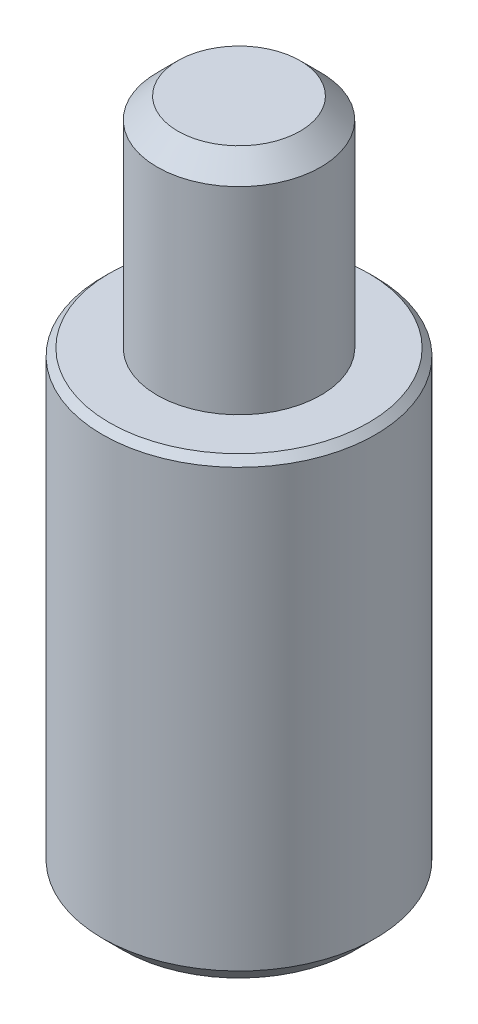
ISO-10303-21;
HEADER;
FILE_DESCRIPTION(('STEP AP214'),'2;1');
FILE_NAME('part.step','',(''),(''),'','','');
FILE_SCHEMA(('AUTOMOTIVE_DESIGN { 1 0 10303 214 1 1 1 1 }'));
ENDSEC;
DATA;
#1=APPLICATION_CONTEXT('core data for automotive mechanical design processes');
#2=APPLICATION_PROTOCOL_DEFINITION('international standard','automotive_design',2000,#1);
#3=PRODUCT_CONTEXT('',#1,'mechanical');
#4=PRODUCT('Part','Part','',(#3));
#5=PRODUCT_RELATED_PRODUCT_CATEGORY('part','',(#4));
#6=PRODUCT_DEFINITION_FORMATION('','',#4);
#7=PRODUCT_DEFINITION_CONTEXT('part definition',#1,'design');
#8=PRODUCT_DEFINITION('design','',#6,#7);
#9=PRODUCT_DEFINITION_SHAPE('','',#8);
#10=(LENGTH_UNIT() NAMED_UNIT(*) SI_UNIT(.MILLI.,.METRE.));
#11=(NAMED_UNIT(*) PLANE_ANGLE_UNIT() SI_UNIT($,.RADIAN.));
#12=(NAMED_UNIT(*) SI_UNIT($,.STERADIAN.) SOLID_ANGLE_UNIT());
#13=UNCERTAINTY_MEASURE_WITH_UNIT(LENGTH_MEASURE(1.E-05),#10,'distance_accuracy_value','');
#14=(GEOMETRIC_REPRESENTATION_CONTEXT(3) GLOBAL_UNCERTAINTY_ASSIGNED_CONTEXT((#13)) GLOBAL_UNIT_ASSIGNED_CONTEXT((#10,
#11,#12)) REPRESENTATION_CONTEXT('',''));
#15=CARTESIAN_POINT('',(0.,0.,0.));
#16=DIRECTION('',(0.,0.,1.));
#17=DIRECTION('',(1.,0.,0.));
#18=AXIS2_PLACEMENT_3D('',#15,#16,#17);
#19=CARTESIAN_POINT('',(0.,17.,0.));
#20=DIRECTION('',(0.,1.,0.));
#21=DIRECTION('',(0.,0.,1.));
#22=AXIS2_PLACEMENT_3D('',#19,#20,#21);
#23=PLANE('',#22);
#24=CARTESIAN_POINT('',(0.,17.,0.));
#25=DIRECTION('',(0.,1.,0.));
#26=DIRECTION('',(0.,0.,1.));
#27=AXIS2_PLACEMENT_3D('',#24,#25,#26);
#28=CIRCLE('',#27,4.746);
#29=CARTESIAN_POINT('',(0.,17.,4.746));
#30=VERTEX_POINT('',#29);
#31=EDGE_CURVE('E186',#30,#30,#28,.T.);
#32=ORIENTED_EDGE('',*,*,#31,.T.);
#33=EDGE_LOOP('',(#32));
#34=FACE_BOUND('',#33,.T.);
#35=CARTESIAN_POINT('',(0.,17.,0.));
#36=DIRECTION('',(0.,1.,0.));
#37=DIRECTION('',(0.,0.,1.));
#38=AXIS2_PLACEMENT_3D('',#35,#36,#37);
#39=CIRCLE('',#38,3.);
#40=CARTESIAN_POINT('',(0.,17.,3.));
#41=VERTEX_POINT('',#40);
#42=EDGE_CURVE('E173',#41,#41,#39,.T.);
#43=ORIENTED_EDGE('',*,*,#42,.F.);
#44=EDGE_LOOP('',(#43));
#45=FACE_BOUND('',#44,.T.);
#46=ADVANCED_FACE('F46',(#34,#45),#23,.T.);
#47=CARTESIAN_POINT('',(0.,17.,0.));
#48=DIRECTION('',(0.,-1.,0.));
#49=DIRECTION('',(0.,0.,-1.));
#50=AXIS2_PLACEMENT_3D('',#47,#48,#49);
#51=CYLINDRICAL_SURFACE('',#50,5.);
#52=CARTESIAN_POINT('',(0.,0.762000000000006,0.));
#53=DIRECTION('',(0.,1.,0.));
#54=DIRECTION('',(0.,0.,1.));
#55=AXIS2_PLACEMENT_3D('',#52,#53,#54);
#56=CIRCLE('',#55,5.);
#57=CARTESIAN_POINT('',(0.,0.762000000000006,5.));
#58=VERTEX_POINT('',#57);
#59=EDGE_CURVE('E194',#58,#58,#56,.T.);
#60=ORIENTED_EDGE('',*,*,#59,.T.);
#61=EDGE_LOOP('',(#60));
#62=FACE_BOUND('',#61,.T.);
#63=CARTESIAN_POINT('',(0.,16.746,0.));
#64=DIRECTION('',(0.,1.,0.));
#65=DIRECTION('',(0.,0.,1.));
#66=AXIS2_PLACEMENT_3D('',#63,#64,#65);
#67=CIRCLE('',#66,5.);
#68=CARTESIAN_POINT('',(0.,16.746,5.));
#69=VERTEX_POINT('',#68);
#70=EDGE_CURVE('E190',#69,#69,#67,.F.);
#71=ORIENTED_EDGE('',*,*,#70,.T.);
#72=EDGE_LOOP('',(#71));
#73=FACE_BOUND('',#72,.T.);
#74=ADVANCED_FACE('F217',(#62,#73),#51,.T.);
#75=CARTESIAN_POINT('',(0.,0.,0.));
#76=DIRECTION('',(0.,1.,0.));
#77=DIRECTION('',(0.,0.,1.));
#78=AXIS2_PLACEMENT_3D('',#75,#76,#77);
#79=PLANE('',#78);
#80=CARTESIAN_POINT('',(0.,0.,0.));
#81=DIRECTION('',(0.,1.,0.));
#82=DIRECTION('',(0.,0.,1.));
#83=AXIS2_PLACEMENT_3D('',#80,#81,#82);
#84=CIRCLE('',#83,4.23799999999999);
#85=CARTESIAN_POINT('',(0.,0.,4.23799999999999));
#86=VERTEX_POINT('',#85);
#87=EDGE_CURVE('E198',#86,#86,#84,.F.);
#88=ORIENTED_EDGE('',*,*,#87,.T.);
#89=EDGE_LOOP('',(#88));
#90=FACE_BOUND('',#89,.T.);
#91=DIRECTION('',(-1.,0.,0.));
#92=VECTOR('',#91,1.);
#93=CARTESIAN_POINT('',(1.44337567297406,0.,2.5));
#94=LINE('',#93,#92);
#95=CARTESIAN_POINT('',(1.44337567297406,0.,2.5));
#96=VERTEX_POINT('',#95);
#97=CARTESIAN_POINT('',(-1.44337567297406,0.,2.5));
#98=VERTEX_POINT('',#97);
#99=EDGE_CURVE('E154',#96,#98,#94,.T.);
#100=ORIENTED_EDGE('',*,*,#99,.F.);
#101=DIRECTION('',(-0.5,0.,0.866025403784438));
#102=VECTOR('',#101,1.);
#103=CARTESIAN_POINT('',(2.88675134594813,0.,0.));
#104=LINE('',#103,#102);
#105=CARTESIAN_POINT('',(2.88675134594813,0.,0.));
#106=VERTEX_POINT('',#105);
#107=EDGE_CURVE('E65',#106,#96,#104,.T.);
#108=ORIENTED_EDGE('',*,*,#107,.F.);
#109=DIRECTION('',(0.5,0.,0.866025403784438));
#110=VECTOR('',#109,1.);
#111=CARTESIAN_POINT('',(1.44337567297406,0.,-2.5));
#112=LINE('',#111,#110);
#113=CARTESIAN_POINT('',(1.44337567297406,0.,-2.5));
#114=VERTEX_POINT('',#113);
#115=EDGE_CURVE('E167',#114,#106,#112,.T.);
#116=ORIENTED_EDGE('',*,*,#115,.F.);
#117=DIRECTION('',(1.,0.,0.));
#118=VECTOR('',#117,1.);
#119=CARTESIAN_POINT('',(-1.44337567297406,0.,-2.5));
#120=LINE('',#119,#118);
#121=CARTESIAN_POINT('',(-1.44337567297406,0.,-2.5));
#122=VERTEX_POINT('',#121);
#123=EDGE_CURVE('E164',#122,#114,#120,.T.);
#124=ORIENTED_EDGE('',*,*,#123,.F.);
#125=DIRECTION('',(0.5,0.,-0.866025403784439));
#126=VECTOR('',#125,1.);
#127=CARTESIAN_POINT('',(-2.88675134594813,0.,0.));
#128=LINE('',#127,#126);
#129=CARTESIAN_POINT('',(-2.88675134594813,0.,0.));
#130=VERTEX_POINT('',#129);
#131=EDGE_CURVE('E122',#130,#122,#128,.T.);
#132=ORIENTED_EDGE('',*,*,#131,.F.);
#133=DIRECTION('',(-0.5,0.,-0.866025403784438));
#134=VECTOR('',#133,1.);
#135=CARTESIAN_POINT('',(-1.44337567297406,0.,2.5));
#136=LINE('',#135,#134);
#137=EDGE_CURVE('E158',#98,#130,#136,.T.);
#138=ORIENTED_EDGE('',*,*,#137,.F.);
#139=EDGE_LOOP('',(#100,#108,#116,#124,#132,#138));
#140=FACE_BOUND('',#139,.T.);
#141=ADVANCED_FACE('F223',(#90,#140),#79,.F.);
#142=CARTESIAN_POINT('',(0.,25.,0.));
#143=DIRECTION('',(0.,-1.,0.));
#144=DIRECTION('',(0.,0.,-1.));
#145=AXIS2_PLACEMENT_3D('',#142,#143,#144);
#146=CYLINDRICAL_SURFACE('',#145,3.);
#147=CARTESIAN_POINT('',(0.,24.24,0.));
#148=DIRECTION('',(0.,1.,0.));
#149=DIRECTION('',(0.,0.,1.));
#150=AXIS2_PLACEMENT_3D('',#147,#148,#149);
#151=CIRCLE('',#150,3.);
#152=CARTESIAN_POINT('',(0.,24.24,3.));
#153=VERTEX_POINT('',#152);
#154=EDGE_CURVE('E11',#153,#153,#151,.F.);
#155=ORIENTED_EDGE('',*,*,#154,.T.);
#156=EDGE_LOOP('',(#155));
#157=FACE_BOUND('',#156,.T.);
#158=ORIENTED_EDGE('',*,*,#42,.T.);
#159=EDGE_LOOP('',(#158));
#160=FACE_BOUND('',#159,.T.);
#161=ADVANCED_FACE('F229',(#157,#160),#146,.T.);
#162=CARTESIAN_POINT('',(0.,25.,0.));
#163=DIRECTION('',(0.,1.,0.));
#164=DIRECTION('',(0.,0.,1.));
#165=AXIS2_PLACEMENT_3D('',#162,#163,#164);
#166=PLANE('',#165);
#167=CARTESIAN_POINT('',(0.,25.,0.));
#168=DIRECTION('',(0.,1.,0.));
#169=DIRECTION('',(0.,0.,1.));
#170=AXIS2_PLACEMENT_3D('',#167,#168,#169);
#171=CIRCLE('',#170,2.24);
#172=CARTESIAN_POINT('',(0.,25.,2.24));
#173=VERTEX_POINT('',#172);
#174=EDGE_CURVE('E55',#173,#173,#171,.T.);
#175=ORIENTED_EDGE('',*,*,#174,.T.);
#176=EDGE_LOOP('',(#175));
#177=FACE_BOUND('',#176,.T.);
#178=ADVANCED_FACE('F206',(#177),#166,.T.);
#179=CARTESIAN_POINT('',(0.,17.,0.));
#180=DIRECTION('',(0.,-1.,0.));
#181=DIRECTION('',(0.,0.,-1.));
#182=AXIS2_PLACEMENT_3D('',#179,#180,#181);
#183=CONICAL_SURFACE('',#182,4.746,0.785398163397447);
#184=ORIENTED_EDGE('',*,*,#70,.F.);
#185=EDGE_LOOP('',(#184));
#186=FACE_BOUND('',#185,.T.);
#187=ORIENTED_EDGE('',*,*,#31,.F.);
#188=EDGE_LOOP('',(#187));
#189=FACE_BOUND('',#188,.T.);
#190=ADVANCED_FACE('F234',(#186,#189),#183,.T.);
#191=CARTESIAN_POINT('',(2.88675134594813,5.,0.));
#192=DIRECTION('',(0.866025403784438,0.,0.5));
#193=DIRECTION('',(0.5,0.,-0.866025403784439));
#194=AXIS2_PLACEMENT_3D('',#191,#192,#193);
#195=PLANE('',#194);
#196=ORIENTED_EDGE('',*,*,#107,.T.);
#197=DIRECTION('',(0.,-1.,0.));
#198=VECTOR('',#197,1.);
#199=CARTESIAN_POINT('',(1.44337567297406,5.,2.5));
#200=LINE('',#199,#198);
#201=CARTESIAN_POINT('',(1.44337567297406,5.,2.5));
#202=VERTEX_POINT('',#201);
#203=EDGE_CURVE('E104',#202,#96,#200,.T.);
#204=ORIENTED_EDGE('',*,*,#203,.F.);
#205=DIRECTION('',(-0.5,0.,0.866025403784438));
#206=VECTOR('',#205,1.);
#207=CARTESIAN_POINT('',(2.88675134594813,5.,0.));
#208=LINE('',#207,#206);
#209=CARTESIAN_POINT('',(2.88675134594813,5.,0.));
#210=VERTEX_POINT('',#209);
#211=EDGE_CURVE('E170',#210,#202,#208,.T.);
#212=ORIENTED_EDGE('',*,*,#211,.F.);
#213=DIRECTION('',(0.,-1.,0.));
#214=VECTOR('',#213,1.);
#215=CARTESIAN_POINT('',(2.88675134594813,5.,0.));
#216=LINE('',#215,#214);
#217=EDGE_CURVE('E75',#210,#106,#216,.T.);
#218=ORIENTED_EDGE('',*,*,#217,.T.);
#219=EDGE_LOOP('',(#196,#204,#212,#218));
#220=FACE_BOUND('',#219,.T.);
#221=ADVANCED_FACE('F236',(#220),#195,.F.);
#222=CARTESIAN_POINT('',(1.44337567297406,5.,-2.5));
#223=DIRECTION('',(0.866025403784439,0.,-0.5));
#224=DIRECTION('',(-0.5,0.,-0.866025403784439));
#225=AXIS2_PLACEMENT_3D('',#222,#223,#224);
#226=PLANE('',#225);
#227=ORIENTED_EDGE('',*,*,#115,.T.);
#228=ORIENTED_EDGE('',*,*,#217,.F.);
#229=DIRECTION('',(0.5,0.,0.866025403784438));
#230=VECTOR('',#229,1.);
#231=CARTESIAN_POINT('',(1.44337567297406,5.,-2.5));
#232=LINE('',#231,#230);
#233=CARTESIAN_POINT('',(1.44337567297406,5.,-2.5));
#234=VERTEX_POINT('',#233);
#235=EDGE_CURVE('E136',#234,#210,#232,.T.);
#236=ORIENTED_EDGE('',*,*,#235,.F.);
#237=DIRECTION('',(0.,-1.,0.));
#238=VECTOR('',#237,1.);
#239=CARTESIAN_POINT('',(1.44337567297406,5.,-2.5));
#240=LINE('',#239,#238);
#241=EDGE_CURVE('E127',#234,#114,#240,.T.);
#242=ORIENTED_EDGE('',*,*,#241,.T.);
#243=EDGE_LOOP('',(#227,#228,#236,#242));
#244=FACE_BOUND('',#243,.T.);
#245=ADVANCED_FACE('F242',(#244),#226,.F.);
#246=CARTESIAN_POINT('',(-1.44337567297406,5.,-2.5));
#247=DIRECTION('',(0.,0.,-1.));
#248=DIRECTION('',(-1.,0.,0.));
#249=AXIS2_PLACEMENT_3D('',#246,#247,#248);
#250=PLANE('',#249);
#251=ORIENTED_EDGE('',*,*,#123,.T.);
#252=ORIENTED_EDGE('',*,*,#241,.F.);
#253=DIRECTION('',(1.,0.,0.));
#254=VECTOR('',#253,1.);
#255=CARTESIAN_POINT('',(-1.44337567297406,5.,-2.5));
#256=LINE('',#255,#254);
#257=CARTESIAN_POINT('',(-1.44337567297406,5.,-2.5));
#258=VERTEX_POINT('',#257);
#259=EDGE_CURVE('E131',#258,#234,#256,.T.);
#260=ORIENTED_EDGE('',*,*,#259,.F.);
#261=DIRECTION('',(0.,-1.,0.));
#262=VECTOR('',#261,1.);
#263=CARTESIAN_POINT('',(-1.44337567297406,5.,-2.5));
#264=LINE('',#263,#262);
#265=EDGE_CURVE('E115',#258,#122,#264,.T.);
#266=ORIENTED_EDGE('',*,*,#265,.T.);
#267=EDGE_LOOP('',(#251,#252,#260,#266));
#268=FACE_BOUND('',#267,.T.);
#269=ADVANCED_FACE('F132',(#268),#250,.F.);
#270=CARTESIAN_POINT('',(-2.88675134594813,5.,0.));
#271=DIRECTION('',(-0.866025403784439,0.,-0.5));
#272=DIRECTION('',(-0.5,0.,0.866025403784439));
#273=AXIS2_PLACEMENT_3D('',#270,#271,#272);
#274=PLANE('',#273);
#275=ORIENTED_EDGE('',*,*,#131,.T.);
#276=ORIENTED_EDGE('',*,*,#265,.F.);
#277=DIRECTION('',(0.5,0.,-0.866025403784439));
#278=VECTOR('',#277,1.);
#279=CARTESIAN_POINT('',(-2.88675134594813,5.,0.));
#280=LINE('',#279,#278);
#281=CARTESIAN_POINT('',(-2.88675134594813,5.,0.));
#282=VERTEX_POINT('',#281);
#283=EDGE_CURVE('E119',#282,#258,#280,.T.);
#284=ORIENTED_EDGE('',*,*,#283,.F.);
#285=DIRECTION('',(0.,-1.,0.));
#286=VECTOR('',#285,1.);
#287=CARTESIAN_POINT('',(-2.88675134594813,5.,0.));
#288=LINE('',#287,#286);
#289=EDGE_CURVE('E128',#282,#130,#288,.T.);
#290=ORIENTED_EDGE('',*,*,#289,.T.);
#291=EDGE_LOOP('',(#275,#276,#284,#290));
#292=FACE_BOUND('',#291,.T.);
#293=ADVANCED_FACE('F117',(#292),#274,.F.);
#294=CARTESIAN_POINT('',(-1.44337567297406,5.,2.5));
#295=DIRECTION('',(-0.866025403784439,0.,0.5));
#296=DIRECTION('',(0.5,0.,0.866025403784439));
#297=AXIS2_PLACEMENT_3D('',#294,#295,#296);
#298=PLANE('',#297);
#299=ORIENTED_EDGE('',*,*,#137,.T.);
#300=ORIENTED_EDGE('',*,*,#289,.F.);
#301=DIRECTION('',(-0.5,0.,-0.866025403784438));
#302=VECTOR('',#301,1.);
#303=CARTESIAN_POINT('',(-1.44337567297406,5.,2.5));
#304=LINE('',#303,#302);
#305=CARTESIAN_POINT('',(-1.44337567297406,5.,2.5));
#306=VERTEX_POINT('',#305);
#307=EDGE_CURVE('E142',#306,#282,#304,.T.);
#308=ORIENTED_EDGE('',*,*,#307,.F.);
#309=DIRECTION('',(0.,-1.,0.));
#310=VECTOR('',#309,1.);
#311=CARTESIAN_POINT('',(-1.44337567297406,5.,2.5));
#312=LINE('',#311,#310);
#313=EDGE_CURVE('E178',#306,#98,#312,.T.);
#314=ORIENTED_EDGE('',*,*,#313,.T.);
#315=EDGE_LOOP('',(#299,#300,#308,#314));
#316=FACE_BOUND('',#315,.T.);
#317=ADVANCED_FACE('F256',(#316),#298,.F.);
#318=CARTESIAN_POINT('',(1.44337567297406,5.,2.5));
#319=DIRECTION('',(0.,0.,1.));
#320=DIRECTION('',(1.,0.,0.));
#321=AXIS2_PLACEMENT_3D('',#318,#319,#320);
#322=PLANE('',#321);
#323=ORIENTED_EDGE('',*,*,#99,.T.);
#324=ORIENTED_EDGE('',*,*,#313,.F.);
#325=DIRECTION('',(-1.,0.,0.));
#326=VECTOR('',#325,1.);
#327=CARTESIAN_POINT('',(1.44337567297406,5.,2.5));
#328=LINE('',#327,#326);
#329=EDGE_CURVE('E147',#202,#306,#328,.T.);
#330=ORIENTED_EDGE('',*,*,#329,.F.);
#331=ORIENTED_EDGE('',*,*,#203,.T.);
#332=EDGE_LOOP('',(#323,#324,#330,#331));
#333=FACE_BOUND('',#332,.T.);
#334=ADVANCED_FACE('F253',(#333),#322,.F.);
#335=CARTESIAN_POINT('',(1.44337567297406,5.,2.5));
#336=DIRECTION('',(0.,-1.,0.));
#337=DIRECTION('',(0.,0.,-1.));
#338=AXIS2_PLACEMENT_3D('',#335,#336,#337);
#339=PLANE('',#338);
#340=ORIENTED_EDGE('',*,*,#211,.T.);
#341=ORIENTED_EDGE('',*,*,#329,.T.);
#342=ORIENTED_EDGE('',*,*,#307,.T.);
#343=ORIENTED_EDGE('',*,*,#283,.T.);
#344=ORIENTED_EDGE('',*,*,#259,.T.);
#345=ORIENTED_EDGE('',*,*,#235,.T.);
#346=EDGE_LOOP('',(#340,#341,#342,#343,#344,#345));
#347=FACE_BOUND('',#346,.T.);
#348=ADVANCED_FACE('F139',(#347),#339,.T.);
#349=CARTESIAN_POINT('',(0.,0.762000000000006,0.));
#350=DIRECTION('',(0.,1.,0.));
#351=DIRECTION('',(0.,0.,1.));
#352=AXIS2_PLACEMENT_3D('',#349,#350,#351);
#353=CONICAL_SURFACE('',#352,5.,0.78539816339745);
#354=ORIENTED_EDGE('',*,*,#87,.F.);
#355=EDGE_LOOP('',(#354));
#356=FACE_BOUND('',#355,.T.);
#357=ORIENTED_EDGE('',*,*,#59,.F.);
#358=EDGE_LOOP('',(#357));
#359=FACE_BOUND('',#358,.T.);
#360=ADVANCED_FACE('F209',(#356,#359),#353,.T.);
#361=CARTESIAN_POINT('',(0.,25.,0.));
#362=DIRECTION('',(0.,-1.,0.));
#363=DIRECTION('',(0.,0.,-1.));
#364=AXIS2_PLACEMENT_3D('',#361,#362,#363);
#365=CONICAL_SURFACE('',#364,2.24,0.785398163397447);
#366=ORIENTED_EDGE('',*,*,#154,.F.);
#367=EDGE_LOOP('',(#366));
#368=FACE_BOUND('',#367,.T.);
#369=ORIENTED_EDGE('',*,*,#174,.F.);
#370=EDGE_LOOP('',(#369));
#371=FACE_BOUND('',#370,.T.);
#372=ADVANCED_FACE('F48',(#368,#371),#365,.T.);
#373=CLOSED_SHELL('',(#46,#74,#141,#161,#178,#190,#221,#245,#269,#293,#317,#334,#348,#360,#372));
#374=MANIFOLD_SOLID_BREP('B2',#373);
#375=ADVANCED_BREP_SHAPE_REPRESENTATION('',(#18,#374),#14);
#376=SHAPE_DEFINITION_REPRESENTATION(#9,#375);
ENDSEC;
END-ISO-10303-21;
